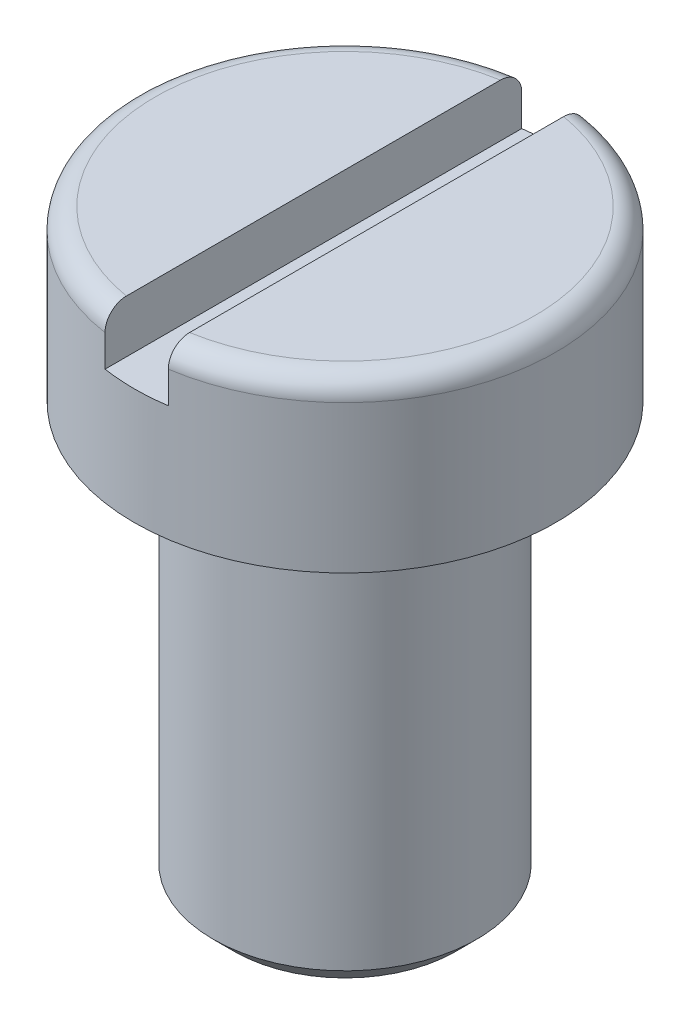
from build123d import *

# Parameters (mm, degrees)
FILLET1_R     = 0.2
SKETCH2_W     = 0.6
SKETCH2_H     = 0.6
SLOT_DEPTH    = 2.5
CHAMFER1_SIZE = 0.2


with BuildPart() as part:
    # Sketch1 → Screw shape (revolve)
    with BuildSketch(Plane.XY, mode=Mode.PRIVATE) as screw_shape_sk:
        Polygon((1.25, 0), (1.25, 4), (2, 4), (2, 5.6), (0, 5.6), (0, 0), align=None)
    revolve(screw_shape_sk.sketch.rotate(Axis((0, 38.58115653, 0), (0, -1, 0)), 90), axis=Axis((0, 38.58115653, 0), (0, -1, 0)))

    # Fillet1
    fillet1_edges = [part.edges().sort_by_distance(p)[0] for p in [
        (0, 5.6, -2),
    ]]
    fillet(fillet1_edges, radius=FILLET1_R)

    # Sketch2 → Slot (cut, symmetric)
    with BuildSketch(Plane.XY):
        with Locations((0, 5.4)):
            Rectangle(SKETCH2_W, SKETCH2_H)
    extrude(amount=SLOT_DEPTH, both=True, mode=Mode.SUBTRACT)

    # Chamfer1
    chamfer1_edges = [part.edges().sort_by_distance(p)[0] for p in [
        (0, 0, -1.25),
    ]]
    chamfer(chamfer1_edges, length=CHAMFER1_SIZE)


solid = part.part
